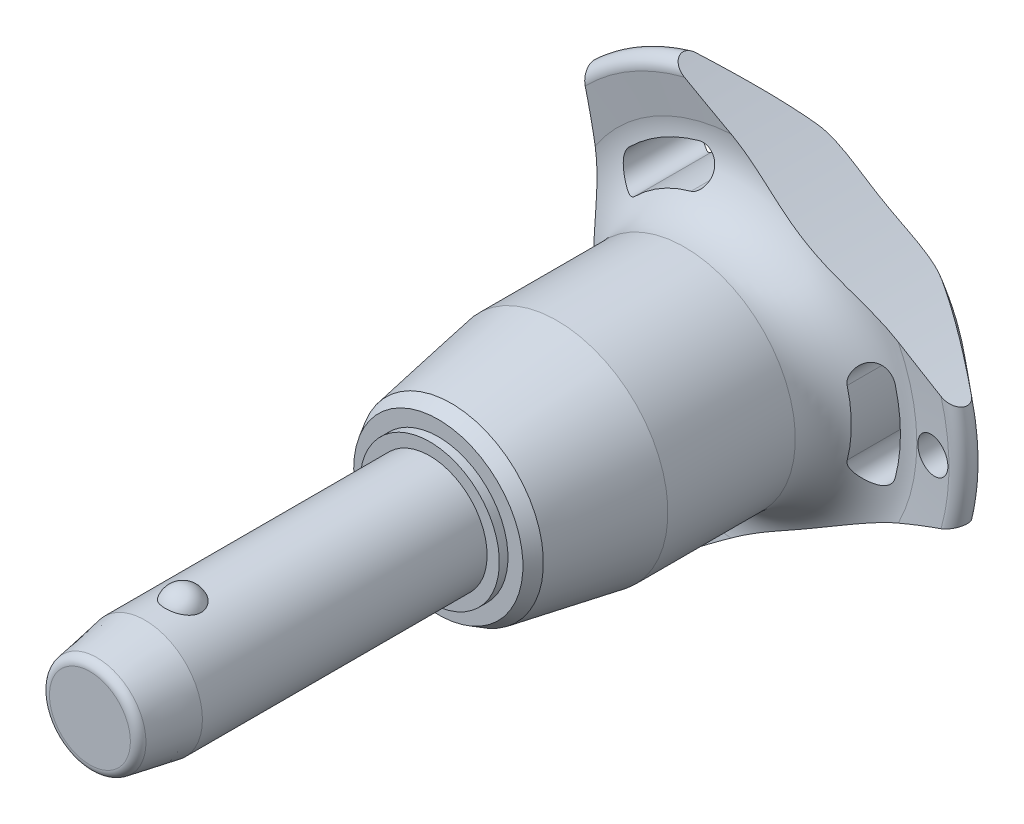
from build123d import *

# Parameters (mm, degrees)
SKETCH1_R           = 5
BOSS_EXTRUDE1_DEPTH = 20
SKETCH2_R           = 4.25
BOSS_EXTRUDE2_DEPTH = 33.3
BOSS_EXTRUDE3_START = 9.6
SKETCH1_2_R         = 5
BOSS_EXTRUDE3_DEPTH = 9.6
CHAMFER1_SIZE       = 4.8
CHAMFER1_SIZE2      = 0.846369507
FILLET1_R           = 0.75
SKETCH6_R           = 102.8
CUT_EXTRUDE1_DEPTH  = 61.079897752
CIRPATTERN1_COUNT   = 3
SKETCH7_R           = 1.5
CUT_EXTRUDE2_DEPTH  = 60.810087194


with BuildPart() as part:
    # Sketch1 → Boss-Extrude1 (new body)
    with BuildSketch(Plane.XY):
        Circle(SKETCH1_R)
    extrude(amount=-BOSS_EXTRUDE1_DEPTH)

    # Sketch2 → Boss-Extrude2 (add)
    with BuildSketch(Plane(origin=(0, 0, -20), x_dir=(-1, 0, 0), z_dir=(0, 0, -1))):
        Circle(SKETCH2_R)
    extrude(amount=BOSS_EXTRUDE2_DEPTH)

    # Sketch3 → Revolve1 (revolve)
    with BuildSketch(Plane(origin=(0, 0, 0), x_dir=(0, 0, -1), z_dir=(1, 0, 0))):
        with BuildLine():
            Line((-1.516575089, 6), (-1.516575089, 2.7))
            ThreePointArc((-1.516575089, 2.7), (0.133424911, 4.35), (-1.516575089, 6))
        make_face()
        with BuildLine():
            Line((-1.516575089, -2.7), (-1.516575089, -6))
            ThreePointArc((-1.516575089, -6), (0.133424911, -4.35), (-1.516575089, -2.7))
        make_face()
    revolve(axis=Axis((0, -2.7, 1.516575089), (0, 1, 0)))

    # Sketch1_2 → Boss-Extrude3 (add)
    with BuildSketch(Plane.XY.offset(BOSS_EXTRUDE3_START)):
        Circle(SKETCH1_2_R)
    extrude(amount=-BOSS_EXTRUDE3_DEPTH)

    # Chamfer1
    chamfer1_edges = [part.edges().sort_by_distance(p)[0] for p in [
        (-5, 0, 9.6),
    ]]
    chamfer1_side = [part.faces().sort_by_distance(p)[0] for p in [
        (-5, 0, -5.2),
    ]]
    chamfer(chamfer1_edges, length=CHAMFER1_SIZE, length2=CHAMFER1_SIZE2, reference=chamfer1_side[0])

    # Fillet1
    fillet1_edges = [part.edges().sort_by_distance(p)[0] for p in [
        (-4.153630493, 0, 9.6),
        (4.25, 0, -53.3),
    ]]
    fillet(fillet1_edges, radius=FILLET1_R)

    # Sketch4 → Revolve2 (revolve)
    with BuildSketch(Plane(origin=(0, 0, 0), x_dir=(0, 0, -1), z_dir=(1, 0, 0)), mode=Mode.PRIVATE) as revolve2_sk:
        Polygon((20, 0), (20, 6.067402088), (20.75, 6.067402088), (20.75, 7.371950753), (21.879772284, 8.024225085), (31.1, 9.65), (42.2, 9.65), (42.2, 0), align=None)
    revolve(revolve2_sk.sketch.rotate(Axis((0, 0, -42.2), (0, 0, 1)), 90), axis=Axis((0, 0, -42.2), (0, 0, 1)))

    # Sketch5 → Revolve3 (revolve)
    with BuildSketch(Plane(origin=(0, 0, 0), x_dir=(0, 0, -1), z_dir=(1, 0, 0)), mode=Mode.PRIVATE) as revolve3_sk:
        with BuildLine():
            Line((47.16082631, 15.274661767), (46.757834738, 18.475067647))
            ThreePointArc((46.757834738, 18.475067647), (47.349836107, 19.516443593), (48.516044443, 19.24278761))
            Line((48.516044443, 19.24278761), (52.835691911, 14.094832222))
            ThreePointArc((52.835691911, 14.094832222), (53.3, 12.689260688), (52.67067517, 11.349423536))
            ThreePointArc((52.67067517, 11.349423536), (49.033110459, 6.185112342), (47.75, 0))
            Line((47.75, 0), (42.2, 0))
            Line((42.2, 0), (42.2, 9.65))
            ThreePointArc((42.2, 9.65), (45.949887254, 11.342683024), (47.16082631, 15.274661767))
        make_face()
    revolve(revolve3_sk.sketch.rotate(Axis((0, 0, -47.75), (0, 0, 1)), 90), axis=Axis((0, 0, -47.75), (0, 0, 1)))

    # Sketch6 → Cut-Extrude1 (cut, through all)
    with BuildSketch(Plane.XY):
        with Locations((-115.2, 0)):
            Circle(SKETCH6_R)
        with BuildLine():
            ThreePointArc((13.411913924, -3.529271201), (13.868496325, 0), (13.411913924, 3.529271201))
            ThreePointArc((13.411913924, 3.529271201), (11.694200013, 4.531299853), (10.692171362, 2.813585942))
            ThreePointArc((10.692171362, 2.813585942), (11.056165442, 0), (10.692171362, -2.813585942))
            ThreePointArc((10.692171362, -2.813585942), (11.694200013, -4.531299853), (13.411913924, -3.529271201))
        make_face()
    cut_extrude1 = extrude(amount=-CUT_EXTRUDE1_DEPTH, mode=Mode.SUBTRACT)

    # CirPattern1: Cut-Extrude1 ×3 about axis
    cirpattern1_axis = Axis((0, 0, 0), (0, 0, 1))
    for i in range(1, CIRPATTERN1_COUNT):
        add(cut_extrude1.rotate(cirpattern1_axis, i * 360 / CIRPATTERN1_COUNT), mode=Mode.SUBTRACT)

    # Sketch7 → Cut-Extrude2 (cut, through all)
    with BuildSketch(Plane.XY):
        with Locations(Location((16.868496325, 0, 0), (0, 0, 225.467095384))):
            Circle(SKETCH7_R)
    extrude(amount=-CUT_EXTRUDE2_DEPTH, mode=Mode.SUBTRACT)


solid = part.part
